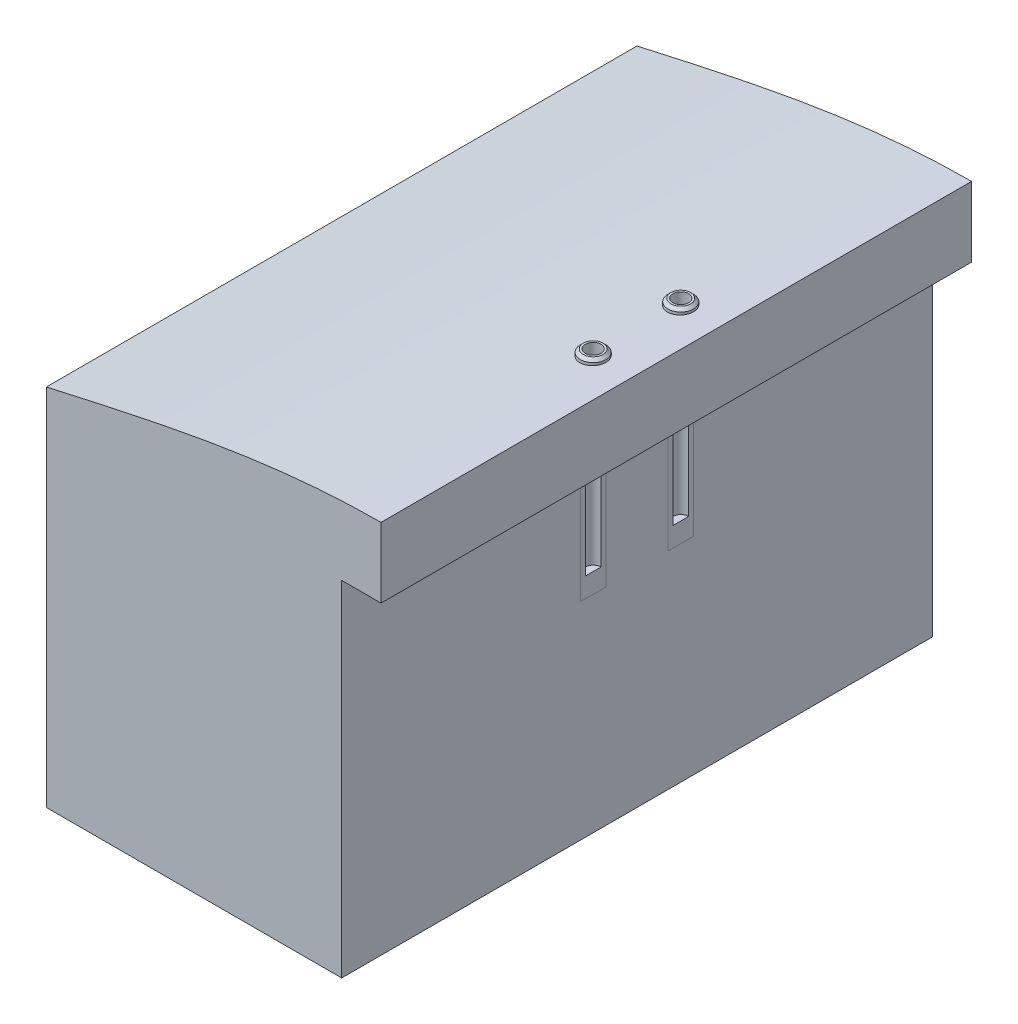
ISO-10303-21;
HEADER;
FILE_DESCRIPTION(('STEP AP214'),'2;1');
FILE_NAME('part.step','',(''),(''),'','','');
FILE_SCHEMA(('AUTOMOTIVE_DESIGN { 1 0 10303 214 1 1 1 1 }'));
ENDSEC;
DATA;
#1=APPLICATION_CONTEXT('core data for automotive mechanical design processes');
#2=APPLICATION_PROTOCOL_DEFINITION('international standard','automotive_design',2000,#1);
#3=PRODUCT_CONTEXT('',#1,'mechanical');
#4=PRODUCT('Part','Part','',(#3));
#5=PRODUCT_RELATED_PRODUCT_CATEGORY('part','',(#4));
#6=PRODUCT_DEFINITION_FORMATION('','',#4);
#7=PRODUCT_DEFINITION_CONTEXT('part definition',#1,'design');
#8=PRODUCT_DEFINITION('design','',#6,#7);
#9=PRODUCT_DEFINITION_SHAPE('','',#8);
#10=(LENGTH_UNIT() NAMED_UNIT(*) SI_UNIT(.MILLI.,.METRE.));
#11=(NAMED_UNIT(*) PLANE_ANGLE_UNIT() SI_UNIT($,.RADIAN.));
#12=(NAMED_UNIT(*) SI_UNIT($,.STERADIAN.) SOLID_ANGLE_UNIT());
#13=UNCERTAINTY_MEASURE_WITH_UNIT(LENGTH_MEASURE(1.E-05),#10,'distance_accuracy_value','');
#14=(GEOMETRIC_REPRESENTATION_CONTEXT(3) GLOBAL_UNCERTAINTY_ASSIGNED_CONTEXT((#13)) GLOBAL_UNIT_ASSIGNED_CONTEXT((#10,
#11,#12)) REPRESENTATION_CONTEXT('',''));
#15=CARTESIAN_POINT('',(0.,0.,0.));
#16=DIRECTION('',(0.,0.,1.));
#17=DIRECTION('',(1.,0.,0.));
#18=AXIS2_PLACEMENT_3D('',#15,#16,#17);
#19=CARTESIAN_POINT('',(0.,-246.769552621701,44.5));
#20=DIRECTION('',(0.,1.,0.));
#21=DIRECTION('',(0.,0.,1.));
#22=AXIS2_PLACEMENT_3D('',#19,#20,#21);
#23=CYLINDRICAL_SURFACE('',#22,13.);
#24=CARTESIAN_POINT('',(0.,2.99999999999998,44.5));
#25=DIRECTION('',(0.,1.,0.));
#26=DIRECTION('',(0.,0.,1.));
#27=AXIS2_PLACEMENT_3D('',#24,#25,#26);
#28=CIRCLE('',#27,13.);
#29=CARTESIAN_POINT('',(0.,2.99999999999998,57.5));
#30=VERTEX_POINT('',#29);
#31=EDGE_CURVE('E119',#30,#30,#28,.F.);
#32=ORIENTED_EDGE('',*,*,#31,.T.);
#33=EDGE_LOOP('',(#32));
#34=FACE_BOUND('',#33,.T.);
#35=CARTESIAN_POINT('',(0.,-70.,44.5));
#36=DIRECTION('',(0.,-1.,0.));
#37=DIRECTION('',(0.,0.,-1.));
#38=AXIS2_PLACEMENT_3D('',#35,#36,#37);
#39=CIRCLE('',#38,13.);
#40=CARTESIAN_POINT('',(0.,-70.,57.5));
#41=VERTEX_POINT('',#40);
#42=CARTESIAN_POINT('',(0.,-70.,31.5));
#43=VERTEX_POINT('',#42);
#44=EDGE_CURVE('E56',#41,#43,#39,.F.);
#45=ORIENTED_EDGE('',*,*,#44,.T.);
#46=DIRECTION('',(0.,1.,0.));
#47=VECTOR('',#46,1.);
#48=CARTESIAN_POINT('',(0.,-246.769552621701,31.5));
#49=LINE('',#48,#47);
#50=CARTESIAN_POINT('',(0.,-210.,31.5));
#51=VERTEX_POINT('',#50);
#52=EDGE_CURVE('E107',#43,#51,#49,.F.);
#53=ORIENTED_EDGE('',*,*,#52,.T.);
#54=CARTESIAN_POINT('',(0.,-210.,44.5));
#55=DIRECTION('',(0.,1.,0.));
#56=DIRECTION('',(0.,0.,1.));
#57=AXIS2_PLACEMENT_3D('',#54,#55,#56);
#58=CIRCLE('',#57,13.);
#59=CARTESIAN_POINT('',(0.,-210.,57.5));
#60=VERTEX_POINT('',#59);
#61=EDGE_CURVE('E114',#60,#51,#58,.F.);
#62=ORIENTED_EDGE('',*,*,#61,.F.);
#63=DIRECTION('',(0.,1.,0.));
#64=VECTOR('',#63,1.);
#65=CARTESIAN_POINT('',(0.,-246.769552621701,57.5));
#66=LINE('',#65,#64);
#67=EDGE_CURVE('E61',#60,#41,#66,.T.);
#68=ORIENTED_EDGE('',*,*,#67,.T.);
#69=EDGE_LOOP('',(#45,#53,#62,#68));
#70=FACE_BOUND('',#69,.T.);
#71=ADVANCED_FACE('F42',(#34,#70),#23,.T.);
#72=CARTESIAN_POINT('',(0.,-210.,44.5));
#73=DIRECTION('',(0.,1.,0.));
#74=DIRECTION('',(0.,0.,1.));
#75=AXIS2_PLACEMENT_3D('',#72,#73,#74);
#76=PLANE('',#75);
#77=DIRECTION('',(0.,0.,-1.));
#78=VECTOR('',#77,1.);
#79=CARTESIAN_POINT('',(0.,-210.,44.5));
#80=LINE('',#79,#78);
#81=EDGE_CURVE('E90',#60,#51,#80,.T.);
#82=ORIENTED_EDGE('',*,*,#81,.F.);
#83=ORIENTED_EDGE('',*,*,#61,.T.);
#84=EDGE_LOOP('',(#82,#83));
#85=FACE_BOUND('',#84,.T.);
#86=ADVANCED_FACE('F134',(#85),#76,.F.);
#87=CARTESIAN_POINT('',(0.,17.3249217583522,44.5));
#88=DIRECTION('',(0.,-1.,0.));
#89=DIRECTION('',(0.,0.,-1.));
#90=AXIS2_PLACEMENT_3D('',#87,#88,#89);
#91=CYLINDRICAL_SURFACE('',#90,8.);
#92=CARTESIAN_POINT('',(0.,6.,44.5));
#93=DIRECTION('',(0.,1.,0.));
#94=DIRECTION('',(0.,0.,1.));
#95=AXIS2_PLACEMENT_3D('',#92,#93,#94);
#96=CIRCLE('',#95,8.);
#97=CARTESIAN_POINT('',(0.,6.,52.5));
#98=VERTEX_POINT('',#97);
#99=EDGE_CURVE('E111',#98,#98,#96,.T.);
#100=ORIENTED_EDGE('',*,*,#99,.T.);
#101=EDGE_LOOP('',(#100));
#102=FACE_BOUND('',#101,.T.);
#103=CARTESIAN_POINT('',(0.,-70.,44.5));
#104=DIRECTION('',(0.,-1.,0.));
#105=DIRECTION('',(0.,0.,-1.));
#106=AXIS2_PLACEMENT_3D('',#103,#104,#105);
#107=CIRCLE('',#106,8.);
#108=CARTESIAN_POINT('',(0.,-70.,36.5));
#109=VERTEX_POINT('',#108);
#110=CARTESIAN_POINT('',(0.,-70.,52.5));
#111=VERTEX_POINT('',#110);
#112=EDGE_CURVE('E13',#109,#111,#107,.T.);
#113=ORIENTED_EDGE('',*,*,#112,.T.);
#114=DIRECTION('',(0.,-1.,0.));
#115=VECTOR('',#114,1.);
#116=CARTESIAN_POINT('',(0.,17.3249217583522,52.5));
#117=LINE('',#116,#115);
#118=CARTESIAN_POINT('',(0.,-190.,52.5));
#119=VERTEX_POINT('',#118);
#120=EDGE_CURVE('E82',#111,#119,#117,.T.);
#121=ORIENTED_EDGE('',*,*,#120,.T.);
#122=CARTESIAN_POINT('',(0.,-190.,44.5));
#123=DIRECTION('',(0.,1.,0.));
#124=DIRECTION('',(0.,0.,1.));
#125=AXIS2_PLACEMENT_3D('',#122,#123,#124);
#126=CIRCLE('',#125,8.);
#127=CARTESIAN_POINT('',(0.,-190.,36.5));
#128=VERTEX_POINT('',#127);
#129=EDGE_CURVE('E101',#119,#128,#126,.F.);
#130=ORIENTED_EDGE('',*,*,#129,.T.);
#131=DIRECTION('',(0.,-1.,0.));
#132=VECTOR('',#131,1.);
#133=CARTESIAN_POINT('',(0.,17.3249217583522,36.5));
#134=LINE('',#133,#132);
#135=EDGE_CURVE('E91',#128,#109,#134,.F.);
#136=ORIENTED_EDGE('',*,*,#135,.T.);
#137=EDGE_LOOP('',(#113,#121,#130,#136));
#138=FACE_BOUND('',#137,.T.);
#139=ADVANCED_FACE('F100',(#102,#138),#91,.F.);
#140=CARTESIAN_POINT('',(0.,-190.,44.5));
#141=DIRECTION('',(0.,1.,0.));
#142=DIRECTION('',(0.,0.,1.));
#143=AXIS2_PLACEMENT_3D('',#140,#141,#142);
#144=PLANE('',#143);
#145=ORIENTED_EDGE('',*,*,#129,.F.);
#146=DIRECTION('',(0.,0.,-1.));
#147=VECTOR('',#146,1.);
#148=CARTESIAN_POINT('',(0.,-190.,44.5));
#149=LINE('',#148,#147);
#150=EDGE_CURVE('E49',#119,#128,#149,.T.);
#151=ORIENTED_EDGE('',*,*,#150,.T.);
#152=EDGE_LOOP('',(#145,#151));
#153=FACE_BOUND('',#152,.T.);
#154=ADVANCED_FACE('F122',(#153),#144,.T.);
#155=CARTESIAN_POINT('',(0.,6.,44.5));
#156=DIRECTION('',(0.,1.,0.));
#157=DIRECTION('',(0.,0.,1.));
#158=AXIS2_PLACEMENT_3D('',#155,#156,#157);
#159=PLANE('',#158);
#160=CARTESIAN_POINT('',(0.,6.,44.5));
#161=DIRECTION('',(0.,1.,0.));
#162=DIRECTION('',(0.,0.,1.));
#163=AXIS2_PLACEMENT_3D('',#160,#161,#162);
#164=CIRCLE('',#163,10.);
#165=CARTESIAN_POINT('',(0.,6.,54.5));
#166=VERTEX_POINT('',#165);
#167=EDGE_CURVE('E116',#166,#166,#164,.T.);
#168=ORIENTED_EDGE('',*,*,#167,.T.);
#169=EDGE_LOOP('',(#168));
#170=FACE_BOUND('',#169,.T.);
#171=ORIENTED_EDGE('',*,*,#99,.F.);
#172=EDGE_LOOP('',(#171));
#173=FACE_BOUND('',#172,.T.);
#174=ADVANCED_FACE('F124',(#170,#173),#159,.T.);
#175=CARTESIAN_POINT('',(0.,5.99999999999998,44.5));
#176=DIRECTION('',(0.,-1.,0.));
#177=DIRECTION('',(0.,0.,-1.));
#178=AXIS2_PLACEMENT_3D('',#175,#176,#177);
#179=CONICAL_SURFACE('',#178,10.,0.78539816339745);
#180=ORIENTED_EDGE('',*,*,#31,.F.);
#181=EDGE_LOOP('',(#180));
#182=FACE_BOUND('',#181,.T.);
#183=ORIENTED_EDGE('',*,*,#167,.F.);
#184=EDGE_LOOP('',(#183));
#185=FACE_BOUND('',#184,.T.);
#186=ADVANCED_FACE('F131',(#182,#185),#179,.T.);
#187=CARTESIAN_POINT('',(40.,-70.,1568.15532611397));
#188=DIRECTION('',(0.,-1.,0.));
#189=DIRECTION('',(0.,0.,-1.));
#190=AXIS2_PLACEMENT_3D('',#187,#188,#189);
#191=PLANE('',#190);
#192=ORIENTED_EDGE('',*,*,#44,.F.);
#193=DIRECTION('',(0.,0.,-1.));
#194=VECTOR('',#193,1.);
#195=CARTESIAN_POINT('',(0.,-70.,1568.15532611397));
#196=LINE('',#195,#194);
#197=EDGE_CURVE('E85',#41,#111,#196,.T.);
#198=ORIENTED_EDGE('',*,*,#197,.T.);
#199=ORIENTED_EDGE('',*,*,#112,.F.);
#200=EDGE_CURVE('E97',#109,#43,#196,.T.);
#201=ORIENTED_EDGE('',*,*,#200,.T.);
#202=EDGE_LOOP('',(#192,#198,#199,#201));
#203=FACE_BOUND('',#202,.T.);
#204=ADVANCED_FACE('F94',(#203),#191,.T.);
#205=CARTESIAN_POINT('',(0.,-70.,1568.15532611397));
#206=DIRECTION('',(1.,0.,0.));
#207=DIRECTION('',(0.,1.,0.));
#208=AXIS2_PLACEMENT_3D('',#205,#206,#207);
#209=PLANE('',#208);
#210=ORIENTED_EDGE('',*,*,#52,.F.);
#211=ORIENTED_EDGE('',*,*,#200,.F.);
#212=ORIENTED_EDGE('',*,*,#135,.F.);
#213=ORIENTED_EDGE('',*,*,#150,.F.);
#214=ORIENTED_EDGE('',*,*,#120,.F.);
#215=ORIENTED_EDGE('',*,*,#197,.F.);
#216=ORIENTED_EDGE('',*,*,#67,.F.);
#217=ORIENTED_EDGE('',*,*,#81,.T.);
#218=EDGE_LOOP('',(#210,#211,#212,#213,#214,#215,#216,#217));
#219=FACE_BOUND('',#218,.T.);
#220=ADVANCED_FACE('F84',(#219),#209,.T.);
#221=CLOSED_SHELL('',(#71,#86,#139,#154,#174,#186,#204,#220));
#222=MANIFOLD_SOLID_BREP('B2',#221);
#223=CARTESIAN_POINT('',(0.,-246.769552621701,-44.5));
#224=DIRECTION('',(0.,1.,0.));
#225=DIRECTION('',(0.,0.,1.));
#226=AXIS2_PLACEMENT_3D('',#223,#224,#225);
#227=CYLINDRICAL_SURFACE('',#226,13.);
#228=CARTESIAN_POINT('',(0.,3.,-44.5));
#229=DIRECTION('',(0.,1.,0.));
#230=DIRECTION('',(0.,0.,1.));
#231=AXIS2_PLACEMENT_3D('',#228,#229,#230);
#232=CIRCLE('',#231,13.);
#233=CARTESIAN_POINT('',(0.,3.,-57.5));
#234=VERTEX_POINT('',#233);
#235=EDGE_CURVE('E271',#234,#234,#232,.F.);
#236=ORIENTED_EDGE('',*,*,#235,.T.);
#237=EDGE_LOOP('',(#236));
#238=FACE_BOUND('',#237,.T.);
#239=CARTESIAN_POINT('',(0.,-70.,-44.5));
#240=DIRECTION('',(0.,-1.,0.));
#241=DIRECTION('',(0.,0.,-1.));
#242=AXIS2_PLACEMENT_3D('',#239,#240,#241);
#243=CIRCLE('',#242,13.);
#244=CARTESIAN_POINT('',(0.,-70.,-31.5));
#245=VERTEX_POINT('',#244);
#246=CARTESIAN_POINT('',(0.,-70.,-57.5));
#247=VERTEX_POINT('',#246);
#248=EDGE_CURVE('E208',#245,#247,#243,.F.);
#249=ORIENTED_EDGE('',*,*,#248,.T.);
#250=DIRECTION('',(0.,1.,0.));
#251=VECTOR('',#250,1.);
#252=CARTESIAN_POINT('',(0.,-246.769552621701,-57.5));
#253=LINE('',#252,#251);
#254=CARTESIAN_POINT('',(0.,-210.,-57.5));
#255=VERTEX_POINT('',#254);
#256=EDGE_CURVE('E259',#247,#255,#253,.F.);
#257=ORIENTED_EDGE('',*,*,#256,.T.);
#258=CARTESIAN_POINT('',(0.,-210.,-44.5));
#259=DIRECTION('',(0.,1.,0.));
#260=DIRECTION('',(0.,0.,1.));
#261=AXIS2_PLACEMENT_3D('',#258,#259,#260);
#262=CIRCLE('',#261,13.);
#263=CARTESIAN_POINT('',(0.,-210.,-31.5));
#264=VERTEX_POINT('',#263);
#265=EDGE_CURVE('E266',#264,#255,#262,.F.);
#266=ORIENTED_EDGE('',*,*,#265,.F.);
#267=DIRECTION('',(0.,1.,0.));
#268=VECTOR('',#267,1.);
#269=CARTESIAN_POINT('',(0.,-246.769552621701,-31.5));
#270=LINE('',#269,#268);
#271=EDGE_CURVE('E213',#264,#245,#270,.T.);
#272=ORIENTED_EDGE('',*,*,#271,.T.);
#273=EDGE_LOOP('',(#249,#257,#266,#272));
#274=FACE_BOUND('',#273,.T.);
#275=ADVANCED_FACE('F194',(#238,#274),#227,.T.);
#276=CARTESIAN_POINT('',(0.,-210.,44.5));
#277=DIRECTION('',(0.,1.,0.));
#278=DIRECTION('',(0.,0.,1.));
#279=AXIS2_PLACEMENT_3D('',#276,#277,#278);
#280=PLANE('',#279);
#281=DIRECTION('',(0.,0.,-1.));
#282=VECTOR('',#281,1.);
#283=CARTESIAN_POINT('',(0.,-210.,44.5));
#284=LINE('',#283,#282);
#285=EDGE_CURVE('E242',#264,#255,#284,.T.);
#286=ORIENTED_EDGE('',*,*,#285,.F.);
#287=ORIENTED_EDGE('',*,*,#265,.T.);
#288=EDGE_LOOP('',(#286,#287));
#289=FACE_BOUND('',#288,.T.);
#290=ADVANCED_FACE('F286',(#289),#280,.F.);
#291=CARTESIAN_POINT('',(0.,17.3249217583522,-44.5));
#292=DIRECTION('',(0.,-1.,0.));
#293=DIRECTION('',(0.,0.,-1.));
#294=AXIS2_PLACEMENT_3D('',#291,#292,#293);
#295=CYLINDRICAL_SURFACE('',#294,8.);
#296=CARTESIAN_POINT('',(0.,6.,-44.5));
#297=DIRECTION('',(0.,1.,0.));
#298=DIRECTION('',(0.,0.,1.));
#299=AXIS2_PLACEMENT_3D('',#296,#297,#298);
#300=CIRCLE('',#299,8.);
#301=CARTESIAN_POINT('',(0.,6.,-36.5));
#302=VERTEX_POINT('',#301);
#303=EDGE_CURVE('E263',#302,#302,#300,.T.);
#304=ORIENTED_EDGE('',*,*,#303,.T.);
#305=EDGE_LOOP('',(#304));
#306=FACE_BOUND('',#305,.T.);
#307=CARTESIAN_POINT('',(0.,-70.,-44.5));
#308=DIRECTION('',(0.,-1.,0.));
#309=DIRECTION('',(0.,0.,-1.));
#310=AXIS2_PLACEMENT_3D('',#307,#308,#309);
#311=CIRCLE('',#310,8.);
#312=CARTESIAN_POINT('',(0.,-70.,-52.5));
#313=VERTEX_POINT('',#312);
#314=CARTESIAN_POINT('',(0.,-70.,-36.5));
#315=VERTEX_POINT('',#314);
#316=EDGE_CURVE('E40',#313,#315,#311,.T.);
#317=ORIENTED_EDGE('',*,*,#316,.T.);
#318=DIRECTION('',(0.,-1.,0.));
#319=VECTOR('',#318,1.);
#320=CARTESIAN_POINT('',(0.,17.3249217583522,-36.5));
#321=LINE('',#320,#319);
#322=CARTESIAN_POINT('',(0.,-190.,-36.5));
#323=VERTEX_POINT('',#322);
#324=EDGE_CURVE('E234',#315,#323,#321,.T.);
#325=ORIENTED_EDGE('',*,*,#324,.T.);
#326=CARTESIAN_POINT('',(0.,-190.,-44.5));
#327=DIRECTION('',(0.,1.,0.));
#328=DIRECTION('',(0.,0.,1.));
#329=AXIS2_PLACEMENT_3D('',#326,#327,#328);
#330=CIRCLE('',#329,8.);
#331=CARTESIAN_POINT('',(0.,-190.,-52.5));
#332=VERTEX_POINT('',#331);
#333=EDGE_CURVE('E253',#323,#332,#330,.F.);
#334=ORIENTED_EDGE('',*,*,#333,.T.);
#335=DIRECTION('',(0.,-1.,0.));
#336=VECTOR('',#335,1.);
#337=CARTESIAN_POINT('',(0.,17.3249217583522,-52.5));
#338=LINE('',#337,#336);
#339=EDGE_CURVE('E243',#332,#313,#338,.F.);
#340=ORIENTED_EDGE('',*,*,#339,.T.);
#341=EDGE_LOOP('',(#317,#325,#334,#340));
#342=FACE_BOUND('',#341,.T.);
#343=ADVANCED_FACE('F252',(#306,#342),#295,.F.);
#344=CARTESIAN_POINT('',(0.,-190.,44.5));
#345=DIRECTION('',(0.,1.,0.));
#346=DIRECTION('',(0.,0.,1.));
#347=AXIS2_PLACEMENT_3D('',#344,#345,#346);
#348=PLANE('',#347);
#349=ORIENTED_EDGE('',*,*,#333,.F.);
#350=DIRECTION('',(0.,0.,-1.));
#351=VECTOR('',#350,1.);
#352=CARTESIAN_POINT('',(0.,-190.,44.5));
#353=LINE('',#352,#351);
#354=EDGE_CURVE('E201',#323,#332,#353,.T.);
#355=ORIENTED_EDGE('',*,*,#354,.T.);
#356=EDGE_LOOP('',(#349,#355));
#357=FACE_BOUND('',#356,.T.);
#358=ADVANCED_FACE('F274',(#357),#348,.T.);
#359=CARTESIAN_POINT('',(0.,6.,-44.5));
#360=DIRECTION('',(0.,1.,0.));
#361=DIRECTION('',(0.,0.,1.));
#362=AXIS2_PLACEMENT_3D('',#359,#360,#361);
#363=PLANE('',#362);
#364=CARTESIAN_POINT('',(0.,6.,-44.5));
#365=DIRECTION('',(0.,1.,0.));
#366=DIRECTION('',(0.,0.,1.));
#367=AXIS2_PLACEMENT_3D('',#364,#365,#366);
#368=CIRCLE('',#367,10.);
#369=CARTESIAN_POINT('',(0.,6.,-54.5));
#370=VERTEX_POINT('',#369);
#371=EDGE_CURVE('E268',#370,#370,#368,.T.);
#372=ORIENTED_EDGE('',*,*,#371,.T.);
#373=EDGE_LOOP('',(#372));
#374=FACE_BOUND('',#373,.T.);
#375=ORIENTED_EDGE('',*,*,#303,.F.);
#376=EDGE_LOOP('',(#375));
#377=FACE_BOUND('',#376,.T.);
#378=ADVANCED_FACE('F276',(#374,#377),#363,.T.);
#379=CARTESIAN_POINT('',(0.,5.99999999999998,-44.5));
#380=DIRECTION('',(0.,-1.,0.));
#381=DIRECTION('',(0.,0.,-1.));
#382=AXIS2_PLACEMENT_3D('',#379,#380,#381);
#383=CONICAL_SURFACE('',#382,10.,0.785398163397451);
#384=CARTESIAN_POINT('',(0.,3.,-57.5));
#385=CARTESIAN_POINT('',(0.,3.03125,-57.46875));
#386=CARTESIAN_POINT('',(0.,3.0625,-57.4375));
#387=CARTESIAN_POINT('',(0.,3.125,-57.375));
#388=CARTESIAN_POINT('',(0.,3.15625,-57.34375));
#389=CARTESIAN_POINT('',(0.,3.21875,-57.28125));
#390=CARTESIAN_POINT('',(0.,3.25,-57.25));
#391=CARTESIAN_POINT('',(0.,3.3125,-57.1875));
#392=CARTESIAN_POINT('',(0.,3.34375,-57.15625));
#393=CARTESIAN_POINT('',(0.,3.40625,-57.09375));
#394=CARTESIAN_POINT('',(0.,3.4375,-57.0625));
#395=CARTESIAN_POINT('',(0.,3.5,-57.));
#396=CARTESIAN_POINT('',(0.,3.53125,-56.96875));
#397=CARTESIAN_POINT('',(0.,3.59375,-56.90625));
#398=CARTESIAN_POINT('',(0.,3.625,-56.875));
#399=CARTESIAN_POINT('',(0.,3.6875,-56.8125));
#400=CARTESIAN_POINT('',(0.,3.71875,-56.78125));
#401=CARTESIAN_POINT('',(0.,3.78125,-56.71875));
#402=CARTESIAN_POINT('',(0.,3.8125,-56.6875));
#403=CARTESIAN_POINT('',(0.,3.875,-56.625));
#404=CARTESIAN_POINT('',(0.,3.90625,-56.59375));
#405=CARTESIAN_POINT('',(0.,3.96875,-56.53125));
#406=CARTESIAN_POINT('',(0.,4.,-56.5));
#407=CARTESIAN_POINT('',(0.,4.0625,-56.4375));
#408=CARTESIAN_POINT('',(0.,4.09375,-56.40625));
#409=CARTESIAN_POINT('',(0.,4.15625,-56.34375));
#410=CARTESIAN_POINT('',(0.,4.1875,-56.3125));
#411=CARTESIAN_POINT('',(0.,4.25,-56.25));
#412=CARTESIAN_POINT('',(0.,4.28125,-56.21875));
#413=CARTESIAN_POINT('',(0.,4.34375,-56.15625));
#414=CARTESIAN_POINT('',(0.,4.375,-56.125));
#415=CARTESIAN_POINT('',(0.,4.4375,-56.0625));
#416=CARTESIAN_POINT('',(0.,4.46875,-56.03125));
#417=CARTESIAN_POINT('',(0.,4.53125,-55.96875));
#418=CARTESIAN_POINT('',(0.,4.5625,-55.9375));
#419=CARTESIAN_POINT('',(0.,4.625,-55.875));
#420=CARTESIAN_POINT('',(0.,4.65625,-55.84375));
#421=CARTESIAN_POINT('',(0.,4.71875,-55.78125));
#422=CARTESIAN_POINT('',(0.,4.75,-55.75));
#423=CARTESIAN_POINT('',(0.,4.8125,-55.6875));
#424=CARTESIAN_POINT('',(0.,4.84375,-55.65625));
#425=CARTESIAN_POINT('',(0.,4.90625,-55.59375));
#426=CARTESIAN_POINT('',(0.,4.9375,-55.5625));
#427=CARTESIAN_POINT('',(0.,5.,-55.5));
#428=CARTESIAN_POINT('',(0.,5.03125,-55.46875));
#429=CARTESIAN_POINT('',(0.,5.09375,-55.40625));
#430=CARTESIAN_POINT('',(0.,5.125,-55.375));
#431=CARTESIAN_POINT('',(0.,5.1875,-55.3125));
#432=CARTESIAN_POINT('',(0.,5.21875,-55.28125));
#433=CARTESIAN_POINT('',(0.,5.28125,-55.21875));
#434=CARTESIAN_POINT('',(0.,5.3125,-55.1875));
#435=CARTESIAN_POINT('',(0.,5.375,-55.125));
#436=CARTESIAN_POINT('',(0.,5.40625,-55.09375));
#437=CARTESIAN_POINT('',(0.,5.46875,-55.03125));
#438=CARTESIAN_POINT('',(0.,5.5,-55.));
#439=CARTESIAN_POINT('',(0.,5.5625,-54.9375));
#440=CARTESIAN_POINT('',(0.,5.59375,-54.90625));
#441=CARTESIAN_POINT('',(0.,5.65625,-54.84375));
#442=CARTESIAN_POINT('',(0.,5.6875,-54.8125));
#443=CARTESIAN_POINT('',(0.,5.75,-54.75));
#444=CARTESIAN_POINT('',(0.,5.78125,-54.71875));
#445=CARTESIAN_POINT('',(0.,5.84375,-54.65625));
#446=CARTESIAN_POINT('',(0.,5.875,-54.625));
#447=CARTESIAN_POINT('',(0.,5.9375,-54.5625));
#448=CARTESIAN_POINT('',(0.,5.96875,-54.53125));
#449=CARTESIAN_POINT('',(0.,6.,-54.5));
#450=B_SPLINE_CURVE_WITH_KNOTS('',3,(#384,#385,#386,#387,#388,#389,#390,#391,#392,#393,#394,
#395,#396,#397,#398,#399,#400,#401,#402,#403,#404,#405,#406,#407,#408,#409,#410,#411,#412,#413,
#414,#415,#416,#417,#418,#419,#420,#421,#422,#423,#424,#425,#426,#427,#428,#429,#430,#431,#432,
#433,#434,#435,#436,#437,#438,#439,#440,#441,#442,#443,#444,#445,#446,#447,#448,#449),
.UNSPECIFIED.,.F.,.F.,(4,2,2,2,2,2,2,2,2,2,2,2,2,2,2,2,2,2,2,2,2,2,2,2,2,2,2,2,2,2,2,2,4),(0.,
0.132582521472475,0.26516504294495,0.397747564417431,0.530330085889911,0.662912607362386,
0.795495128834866,0.928077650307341,1.06066017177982,1.1932426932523,1.32582521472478,
1.45840773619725,1.59099025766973,1.72357277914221,1.85615530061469,1.98873782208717,
2.12132034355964,2.25390286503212,2.3864853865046,2.51906790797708,2.65165042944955,
2.78423295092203,2.91681547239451,3.04939799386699,3.18198051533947,3.31456303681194,
3.44714555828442,3.5797280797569,3.71231060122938,3.84489312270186,3.97747564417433,
4.11005816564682,4.24264068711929),.UNSPECIFIED.);
#451=EDGE_CURVE('BSEAM283',#234,#370,#450,.T.);
#452=ORIENTED_EDGE('',*,*,#235,.F.);
#453=ORIENTED_EDGE('',*,*,#371,.F.);
#454=ORIENTED_EDGE('',*,*,#451,.T.);
#455=ORIENTED_EDGE('',*,*,#451,.F.);
#456=EDGE_LOOP('',(#452,#454,#453,#455));
#457=FACE_BOUND('',#456,.T.);
#458=ADVANCED_FACE('F283',(#457),#383,.T.);
#459=CARTESIAN_POINT('',(40.,-70.,1568.15532611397));
#460=DIRECTION('',(0.,-1.,0.));
#461=DIRECTION('',(0.,0.,-1.));
#462=AXIS2_PLACEMENT_3D('',#459,#460,#461);
#463=PLANE('',#462);
#464=ORIENTED_EDGE('',*,*,#248,.F.);
#465=DIRECTION('',(0.,0.,-1.));
#466=VECTOR('',#465,1.);
#467=CARTESIAN_POINT('',(0.,-70.,1568.15532611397));
#468=LINE('',#467,#466);
#469=EDGE_CURVE('E237',#245,#315,#468,.T.);
#470=ORIENTED_EDGE('',*,*,#469,.T.);
#471=ORIENTED_EDGE('',*,*,#316,.F.);
#472=EDGE_CURVE('E249',#313,#247,#468,.T.);
#473=ORIENTED_EDGE('',*,*,#472,.T.);
#474=EDGE_LOOP('',(#464,#470,#471,#473));
#475=FACE_BOUND('',#474,.T.);
#476=ADVANCED_FACE('F246',(#475),#463,.T.);
#477=CARTESIAN_POINT('',(0.,-70.,1568.15532611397));
#478=DIRECTION('',(1.,0.,0.));
#479=DIRECTION('',(0.,1.,0.));
#480=AXIS2_PLACEMENT_3D('',#477,#478,#479);
#481=PLANE('',#480);
#482=ORIENTED_EDGE('',*,*,#256,.F.);
#483=ORIENTED_EDGE('',*,*,#472,.F.);
#484=ORIENTED_EDGE('',*,*,#339,.F.);
#485=ORIENTED_EDGE('',*,*,#354,.F.);
#486=ORIENTED_EDGE('',*,*,#324,.F.);
#487=ORIENTED_EDGE('',*,*,#469,.F.);
#488=ORIENTED_EDGE('',*,*,#271,.F.);
#489=ORIENTED_EDGE('',*,*,#285,.T.);
#490=EDGE_LOOP('',(#482,#483,#484,#485,#486,#487,#488,#489));
#491=FACE_BOUND('',#490,.T.);
#492=ADVANCED_FACE('F236',(#491),#481,.T.);
#493=CLOSED_SHELL('',(#275,#290,#343,#358,#378,#458,#476,#492));
#494=MANIFOLD_SOLID_BREP('B7',#493);
#495=CARTESIAN_POINT('',(300.,-19.844883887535,300.));
#496=CARTESIAN_POINT('',(199.717435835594,-7.50258695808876,300.));
#497=CARTESIAN_POINT('',(-2.00076682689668,17.3239217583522,300.));
#498=CARTESIAN_POINT('',(-200.289099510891,-27.3701210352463,300.));
#499=CARTESIAN_POINT('',(-300.,-49.844883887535,300.));
#500=B_SPLINE_CURVE_WITH_KNOTS('',3,(#495,#496,#497,#498,#499),.UNSPECIFIED.,.F.,.F.,(4,1,4),
(0.,0.49714186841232,1.),.UNSPECIFIED.);
#501=DIRECTION('',(0.,0.,-1.));
#502=VECTOR('',#501,1.);
#503=SURFACE_OF_LINEAR_EXTRUSION('',#500,#502);
#504=CARTESIAN_POINT('',(0.,0.,-57.5));
#505=CARTESIAN_POINT('',(-0.365705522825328,-0.0177995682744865,-57.5000025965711));
#506=CARTESIAN_POINT('',(-0.731356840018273,-0.0358301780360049,-57.484562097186));
#507=CARTESIAN_POINT('',(-1.46015986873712,-0.0722284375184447,-57.4229127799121));
#508=CARTESIAN_POINT('',(-1.82331089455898,-0.0905961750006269,-57.3766958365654));
#509=CARTESIAN_POINT('',(-2.54479918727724,-0.127536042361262,-57.2537472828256));
#510=CARTESIAN_POINT('',(-2.90313082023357,-0.146108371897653,-57.1769827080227));
#511=CARTESIAN_POINT('',(-3.61203650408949,-0.183280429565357,-56.9934879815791));
#512=CARTESIAN_POINT('',(-3.9626105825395,-0.201880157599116,-56.8867579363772));
#513=CARTESIAN_POINT('',(-4.65334041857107,-0.238931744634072,-56.6441488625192));
#514=CARTESIAN_POINT('',(-4.99350111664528,-0.25738367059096,-56.5082839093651));
#515=CARTESIAN_POINT('',(-5.66116887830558,-0.293976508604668,-56.2083348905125));
#516=CARTESIAN_POINT('',(-5.98867574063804,-0.312117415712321,-56.0442503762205));
#517=CARTESIAN_POINT('',(-6.62861834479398,-0.347906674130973,-55.6890707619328));
#518=CARTESIAN_POINT('',(-6.94105792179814,-0.3655551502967,-55.4979825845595));
#519=CARTESIAN_POINT('',(-7.54873077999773,-0.40018627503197,-55.0901165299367));
#520=CARTESIAN_POINT('',(-7.84396413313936,-0.4171689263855,-54.8733387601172));
#521=CARTESIAN_POINT('',(-8.41509466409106,-0.450290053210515,-54.4156485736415));
#522=CARTESIAN_POINT('',(-8.69099367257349,-0.466428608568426,-54.1747384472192));
#523=CARTESIAN_POINT('',(-9.22151722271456,-0.497690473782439,-53.6704719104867));
#524=CARTESIAN_POINT('',(-9.47614174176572,-0.512813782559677,-53.4071154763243));
#525=CARTESIAN_POINT('',(-9.96230333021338,-0.541879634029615,-52.8598139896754));
#526=CARTESIAN_POINT('',(-10.1938395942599,-0.555822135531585,-52.5758682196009));
#527=CARTESIAN_POINT('',(-10.6321547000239,-0.582369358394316,-51.9894124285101));
#528=CARTESIAN_POINT('',(-10.8389335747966,-0.594974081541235,-51.6869024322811));
#529=CARTESIAN_POINT('',(-11.2259823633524,-0.618685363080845,-51.0658967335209));
#530=CARTESIAN_POINT('',(-11.4062883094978,-0.629793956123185,-50.7474235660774));
#531=CARTESIAN_POINT('',(-11.7394349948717,-0.650404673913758,-50.0963719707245));
#532=CARTESIAN_POINT('',(-11.8922757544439,-0.659906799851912,-49.7637935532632));
#533=CARTESIAN_POINT('',(-12.1693908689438,-0.677192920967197,-49.0869018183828));
#534=CARTESIAN_POINT('',(-12.2936655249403,-0.684976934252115,-48.7425886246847));
#535=CARTESIAN_POINT('',(-12.5127544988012,-0.698734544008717,-48.044678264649));
#536=CARTESIAN_POINT('',(-12.6075688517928,-0.70470814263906,-47.6910811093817));
#537=CARTESIAN_POINT('',(-12.7669098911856,-0.714764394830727,-46.9777661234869));
#538=CARTESIAN_POINT('',(-12.8314905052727,-0.718850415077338,-46.6180603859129));
#539=CARTESIAN_POINT('',(-12.9301496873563,-0.725098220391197,-45.8944735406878));
#540=CARTESIAN_POINT('',(-12.9642282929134,-0.727260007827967,-45.530592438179));
#541=CARTESIAN_POINT('',(-13.0016376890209,-0.729633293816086,-44.8012498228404));
#542=CARTESIAN_POINT('',(-13.0049687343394,-0.729844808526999,-44.4357883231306));
#543=CARTESIAN_POINT('',(-12.9808596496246,-0.728315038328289,-43.7058858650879));
#544=CARTESIAN_POINT('',(-12.9534195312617,-0.7265737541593,-43.3414449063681));
#545=CARTESIAN_POINT('',(-12.8680098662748,-0.721162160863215,-42.6165518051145));
#546=CARTESIAN_POINT('',(-12.8100716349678,-0.717493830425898,-42.2560959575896));
#547=CARTESIAN_POINT('',(-12.6641012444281,-0.708273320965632,-41.5413550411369));
#548=CARTESIAN_POINT('',(-12.576069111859,-0.702721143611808,-41.187069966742));
#549=CARTESIAN_POINT('',(-12.3705430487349,-0.689799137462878,-40.487184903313));
#550=CARTESIAN_POINT('',(-12.2530490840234,-0.682429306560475,-40.1415849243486));
#551=CARTESIAN_POINT('',(-11.989441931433,-0.665959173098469,-39.4615204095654));
#552=CARTESIAN_POINT('',(-11.8433287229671,-0.656858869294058,-39.1270558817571));
#553=CARTESIAN_POINT('',(-11.5234511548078,-0.637029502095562,-38.471470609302));
#554=CARTESIAN_POINT('',(-11.3496733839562,-0.626299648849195,-38.1503564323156));
#555=CARTESIAN_POINT('',(-10.9757602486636,-0.603338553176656,-37.5239160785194));
#556=CARTESIAN_POINT('',(-10.7756248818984,-0.591107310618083,-37.2185899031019));
#557=CARTESIAN_POINT('',(-10.3504231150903,-0.565282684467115,-36.6258798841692));
#558=CARTESIAN_POINT('',(-10.125356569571,-0.551689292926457,-36.3384961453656));
#559=CARTESIAN_POINT('',(-9.65189541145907,-0.523292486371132,-35.7836987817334));
#560=CARTESIAN_POINT('',(-9.40350076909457,-0.50848906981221,-35.5162851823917));
#561=CARTESIAN_POINT('',(-8.88472273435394,-0.47780925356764,-35.0028901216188));
#562=CARTESIAN_POINT('',(-8.61430397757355,-0.461931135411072,-34.7569444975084));
#563=CARTESIAN_POINT('',(-8.05375514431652,-0.429294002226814,-34.288712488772));
#564=CARTESIAN_POINT('',(-7.76362504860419,-0.412534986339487,-34.0664261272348));
#565=CARTESIAN_POINT('',(-7.16571098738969,-0.378310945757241,-33.6470775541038));
#566=CARTESIAN_POINT('',(-6.8579268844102,-0.360845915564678,-33.4500155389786));
#567=CARTESIAN_POINT('',(-6.22688863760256,-0.325386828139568,-33.0825056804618));
#568=CARTESIAN_POINT('',(-5.90363447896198,-0.307392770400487,-32.9120578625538));
#569=CARTESIAN_POINT('',(-5.24340124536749,-0.271021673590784,-32.5987191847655));
#570=CARTESIAN_POINT('',(-4.90640044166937,-0.252644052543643,-32.4558741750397));
#571=CARTESIAN_POINT('',(-4.22156619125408,-0.215708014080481,-32.1991011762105));
#572=CARTESIAN_POINT('',(-3.87373273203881,-0.197149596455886,-32.0851732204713));
#573=CARTESIAN_POINT('',(-3.16969991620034,-0.160019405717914,-31.8870410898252));
#574=CARTESIAN_POINT('',(-2.81350052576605,-0.141447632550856,-31.8028370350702));
#575=CARTESIAN_POINT('',(-2.09526445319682,-0.104450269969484,-31.6647516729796));
#576=CARTESIAN_POINT('',(-1.73322777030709,-0.086024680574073,-31.610870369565));
#577=CARTESIAN_POINT('',(-1.0056381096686,-0.0494565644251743,-31.5337894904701));
#578=CARTESIAN_POINT('',(-0.640082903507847,-0.0313142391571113,-31.5106108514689));
#579=CARTESIAN_POINT('',(0.0917013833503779,0.00453604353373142,-31.4951729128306));
#580=CARTESIAN_POINT('',(0.457930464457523,0.0222440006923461,-31.5029136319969));
#581=CARTESIAN_POINT('',(1.18845640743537,0.0571030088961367,-31.5492654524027));
#582=CARTESIAN_POINT('',(1.55275327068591,0.0742540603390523,-31.5878765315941));
#583=CARTESIAN_POINT('',(2.27682070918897,0.107891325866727,-31.695701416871));
#584=CARTESIAN_POINT('',(2.63659128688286,0.124377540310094,-31.7649152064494));
#585=CARTESIAN_POINT('',(3.34889344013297,0.15658422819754,-31.9334253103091));
#586=CARTESIAN_POINT('',(3.70142796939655,0.172305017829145,-32.032709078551));
#587=CARTESIAN_POINT('',(4.39689944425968,0.202908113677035,-32.2606704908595));
#588=CARTESIAN_POINT('',(4.73983639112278,0.217790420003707,-32.3893481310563));
#589=CARTESIAN_POINT('',(5.41366449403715,0.246649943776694,-32.6751882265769));
#590=CARTESIAN_POINT('',(5.74455569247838,0.260627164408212,-32.8323505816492));
#591=CARTESIAN_POINT('',(6.39193028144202,0.287622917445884,-33.1740479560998));
#592=CARTESIAN_POINT('',(6.70841368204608,0.30064145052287,-33.3585829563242));
#593=CARTESIAN_POINT('',(7.3244183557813,0.325666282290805,-33.7535294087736));
#594=CARTESIAN_POINT('',(7.62395542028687,0.337673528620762,-33.9639161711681));
#595=CARTESIAN_POINT('',(8.20425273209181,0.360658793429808,-34.4092123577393));
#596=CARTESIAN_POINT('',(8.48501298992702,0.371636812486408,-34.6441217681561));
#597=CARTESIAN_POINT('',(9.02575011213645,0.392542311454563,-35.1367946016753));
#598=CARTESIAN_POINT('',(9.28572704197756,0.402469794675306,-35.3945579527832));
#599=CARTESIAN_POINT('',(9.78304017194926,0.421261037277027,-35.9311070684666));
#600=CARTESIAN_POINT('',(10.0203763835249,0.430124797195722,-36.2098928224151));
#601=CARTESIAN_POINT('',(10.4705117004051,0.446774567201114,-36.7862480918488));
#602=CARTESIAN_POINT('',(10.6833323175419,0.454561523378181,-37.0838007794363));
#603=CARTESIAN_POINT('',(11.083159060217,0.469065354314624,-37.6957965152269));
#604=CARTESIAN_POINT('',(11.2701652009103,0.475782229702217,-38.010239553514));
#605=CARTESIAN_POINT('',(11.6170267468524,0.488147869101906,-38.6537787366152));
#606=CARTESIAN_POINT('',(11.7768822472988,0.493796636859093,-38.9828748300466));
#607=CARTESIAN_POINT('',(12.0683013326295,0.504030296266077,-39.6533797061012));
#608=CARTESIAN_POINT('',(12.1998649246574,0.508615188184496,-39.9947884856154));
#609=CARTESIAN_POINT('',(12.4336942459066,0.516723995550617,-40.6872933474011));
#610=CARTESIAN_POINT('',(12.5359764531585,0.520248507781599,-41.0383838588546));
#611=CARTESIAN_POINT('',(12.7106119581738,0.526245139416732,-41.7479398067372));
#612=CARTESIAN_POINT('',(12.7829652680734,0.528717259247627,-42.1064052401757));
#613=CARTESIAN_POINT('',(12.8972265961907,0.532613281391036,-42.8281617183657));
#614=CARTESIAN_POINT('',(12.9391346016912,0.5340371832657,-43.1914527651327));
#615=CARTESIAN_POINT('',(12.9922061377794,0.535839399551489,-43.920276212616));
#616=CARTESIAN_POINT('',(13.0033696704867,0.536217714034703,-44.2858086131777));
#617=CARTESIAN_POINT('',(12.9948736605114,0.535929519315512,-45.0164226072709));
#618=CARTESIAN_POINT('',(12.975221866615,0.535263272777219,-45.3815042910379));
#619=CARTESIAN_POINT('',(12.9052498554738,0.532885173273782,-46.1087132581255));
#620=CARTESIAN_POINT('',(12.8549296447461,0.531173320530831,-46.4708405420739));
#621=CARTESIAN_POINT('',(12.7239797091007,0.526700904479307,-47.1895667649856));
#622=CARTESIAN_POINT('',(12.6433499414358,0.523940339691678,-47.5461656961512));
#623=CARTESIAN_POINT('',(12.4523561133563,0.517366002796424,-48.2512998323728));
#624=CARTESIAN_POINT('',(12.3419920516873,0.513552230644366,-48.5998350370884));
#625=CARTESIAN_POINT('',(12.0923147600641,0.504866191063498,-49.2863706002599));
#626=CARTESIAN_POINT('',(11.9530010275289,0.499993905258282,-49.6243707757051));
#627=CARTESIAN_POINT('',(11.6464192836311,0.489185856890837,-50.2874283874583));
#628=CARTESIAN_POINT('',(11.4791512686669,0.483250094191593,-50.6124858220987));
#629=CARTESIAN_POINT('',(11.117860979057,0.470311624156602,-51.2473367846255));
#630=CARTESIAN_POINT('',(10.9238397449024,0.463308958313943,-51.5571309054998));
#631=CARTESIAN_POINT('',(10.5104216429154,0.448235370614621,-52.1592694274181));
#632=CARTESIAN_POINT('',(10.2910247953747,0.440164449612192,-52.4516138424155));
#633=CARTESIAN_POINT('',(9.82838659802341,0.422955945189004,-53.0168191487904));
#634=CARTESIAN_POINT('',(9.58514189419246,0.413818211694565,-53.2896772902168));
#635=CARTESIAN_POINT('',(9.07656666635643,0.39448520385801,-53.8139310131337));
#636=CARTESIAN_POINT('',(8.81123605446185,0.384289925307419,-54.0653265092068));
#637=CARTESIAN_POINT('',(8.26030959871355,0.362854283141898,-54.5449343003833));
#638=CARTESIAN_POINT('',(7.9747085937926,0.351613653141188,-54.773140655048));
#639=CARTESIAN_POINT('',(7.38534090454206,0.328113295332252,-55.2046780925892));
#640=CARTESIAN_POINT('',(7.08157449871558,0.315853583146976,-55.40800955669));
#641=CARTESIAN_POINT('',(6.45770829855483,0.290334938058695,-55.7885627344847));
#642=CARTESIAN_POINT('',(6.13759179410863,0.277074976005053,-55.9657569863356));
#643=CARTESIAN_POINT('',(5.48360006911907,0.249611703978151,-56.2925297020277));
#644=CARTESIAN_POINT('',(5.14972478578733,0.235408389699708,-56.4421080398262));
#645=CARTESIAN_POINT('',(4.47095044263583,0.206130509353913,-56.7124486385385));
#646=CARTESIAN_POINT('',(4.12606355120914,0.191056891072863,-56.833241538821));
#647=CARTESIAN_POINT('',(3.42749650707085,0.160099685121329,-57.0453382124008));
#648=CARTESIAN_POINT('',(3.07381867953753,0.144216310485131,-57.1366496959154));
#649=CARTESIAN_POINT('',(2.27079183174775,0.10765256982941,-57.3082598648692));
#650=CARTESIAN_POINT('',(1.81962081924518,0.0867653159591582,-57.3801047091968));
#651=CARTESIAN_POINT('',(0.91227176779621,0.0440384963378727,-57.4759731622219));
#652=CARTESIAN_POINT('',(0.45609372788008,0.0221989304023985,-57.4999967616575));
#653=CARTESIAN_POINT('',(0.,0.,-57.5));
#654=B_SPLINE_CURVE_WITH_KNOTS('',3,(#504,#505,#506,#507,#508,#509,#510,#511,#512,#513,#514,
#515,#516,#517,#518,#519,#520,#521,#522,#523,#524,#525,#526,#527,#528,#529,#530,#531,#532,#533,
#534,#535,#536,#537,#538,#539,#540,#541,#542,#543,#544,#545,#546,#547,#548,#549,#550,#551,#552,
#553,#554,#555,#556,#557,#558,#559,#560,#561,#562,#563,#564,#565,#566,#567,#568,#569,#570,#571,
#572,#573,#574,#575,#576,#577,#578,#579,#580,#581,#582,#583,#584,#585,#586,#587,#588,#589,#590,
#591,#592,#593,#594,#595,#596,#597,#598,#599,#600,#601,#602,#603,#604,#605,#606,#607,#608,#609,
#610,#611,#612,#613,#614,#615,#616,#617,#618,#619,#620,#621,#622,#623,#624,#625,#626,#627,#628,
#629,#630,#631,#632,#633,#634,#635,#636,#637,#638,#639,#640,#641,#642,#643,#644,#645,#646,#647,
#648,#649,#650,#651,#652,#653),.UNSPECIFIED.,.T.,.F.,(4,2,2,2,2,2,2,2,2,2,2,2,2,2,2,2,2,2,2,2,2,
2,2,2,2,2,2,2,2,2,2,2,2,2,2,2,2,2,2,2,2,2,2,2,2,2,2,2,2,2,2,2,2,2,2,2,2,2,2,2,2,2,2,2,2,2,2,2,2,
2,2,2,2,2,4),(0.,1.0980162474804,2.19632250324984,3.29581718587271,4.39530796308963,
5.49426875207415,6.59324701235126,7.6919440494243,8.7906364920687,9.88922476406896,
10.9878142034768,12.086441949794,13.1850682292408,14.2821850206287,15.3793009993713,
16.4764054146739,17.5735085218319,18.6686472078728,19.7637845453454,20.8589128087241,
21.954040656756,23.0480462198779,24.1420508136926,25.236056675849,26.3300633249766,
27.4246019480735,28.5191406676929,29.6136857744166,30.70823227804,31.8045723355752,
32.9009134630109,33.9972631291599,35.093613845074,36.1917703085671,37.289928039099,
38.3880902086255,39.4862525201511,40.5851633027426,41.6840747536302,42.7829854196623,
43.8818954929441,44.9803477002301,46.0787997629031,47.1772479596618,48.2756953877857,
49.3731017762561,50.4705075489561,51.5679098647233,52.665311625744,53.7617429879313,
54.8581737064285,55.9546005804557,57.0510271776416,58.1468355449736,59.2426434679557,
60.3384518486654,61.4342601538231,62.529792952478,63.6253255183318,64.7208596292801,
65.8163937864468,66.9119469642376,68.0075002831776,69.1030110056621,70.1985208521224,
71.2941849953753,72.3898534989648,73.485801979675,74.5817336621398,75.6788087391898,
76.7758888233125,77.871795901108,78.9674161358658,80.336819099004,81.7062223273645),.UNSPECIFIED.);
#655=CARTESIAN_POINT('',(0.,0.,-57.5));
#656=VERTEX_POINT('',#655);
#657=EDGE_CURVE('E492',#656,#656,#654,.T.);
#658=ORIENTED_EDGE('',*,*,#657,.F.);
#659=EDGE_LOOP('',(#658));
#660=FACE_BOUND('',#659,.T.);
#661=CARTESIAN_POINT('',(0.,0.,31.5));
#662=CARTESIAN_POINT('',(-0.365705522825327,-0.0177995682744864,31.4999974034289));
#663=CARTESIAN_POINT('',(-0.731356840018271,-0.0358301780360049,31.515437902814));
#664=CARTESIAN_POINT('',(-1.46015986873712,-0.0722284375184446,31.5770872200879));
#665=CARTESIAN_POINT('',(-1.82331089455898,-0.0905961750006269,31.6233041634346));
#666=CARTESIAN_POINT('',(-2.54479918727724,-0.127536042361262,31.7462527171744));
#667=CARTESIAN_POINT('',(-2.90313082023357,-0.146108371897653,31.8230172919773));
#668=CARTESIAN_POINT('',(-3.61203650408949,-0.183280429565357,32.0065120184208));
#669=CARTESIAN_POINT('',(-3.9626105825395,-0.201880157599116,32.1132420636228));
#670=CARTESIAN_POINT('',(-4.65334041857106,-0.238931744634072,32.3558511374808));
#671=CARTESIAN_POINT('',(-4.99350111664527,-0.257383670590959,32.4917160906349));
#672=CARTESIAN_POINT('',(-5.66116887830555,-0.293976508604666,32.7916651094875));
#673=CARTESIAN_POINT('',(-5.98867574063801,-0.31211741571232,32.9557496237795));
#674=CARTESIAN_POINT('',(-6.62861834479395,-0.347906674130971,33.3109292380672));
#675=CARTESIAN_POINT('',(-6.94105792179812,-0.365555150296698,33.5020174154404));
#676=CARTESIAN_POINT('',(-7.54873077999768,-0.400186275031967,33.9098834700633));
#677=CARTESIAN_POINT('',(-7.84396413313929,-0.417168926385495,34.1266612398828));
#678=CARTESIAN_POINT('',(-8.41509466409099,-0.450290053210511,34.5843514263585));
#679=CARTESIAN_POINT('',(-8.69099367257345,-0.466428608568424,34.8252615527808));
#680=CARTESIAN_POINT('',(-9.22151722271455,-0.497690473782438,35.3295280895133));
#681=CARTESIAN_POINT('',(-9.47614174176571,-0.512813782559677,35.5928845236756));
#682=CARTESIAN_POINT('',(-9.96230333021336,-0.541879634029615,36.1401860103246));
#683=CARTESIAN_POINT('',(-10.1938395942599,-0.555822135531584,36.4241317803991));
#684=CARTESIAN_POINT('',(-10.6321547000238,-0.582369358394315,37.0105875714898));
#685=CARTESIAN_POINT('',(-10.8389335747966,-0.594974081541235,37.3130975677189));
#686=CARTESIAN_POINT('',(-11.2259823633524,-0.618685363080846,37.934103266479));
#687=CARTESIAN_POINT('',(-11.4062883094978,-0.629793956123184,38.2525764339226));
#688=CARTESIAN_POINT('',(-11.7394349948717,-0.650404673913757,38.9036280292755));
#689=CARTESIAN_POINT('',(-11.8922757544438,-0.659906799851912,39.2362064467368));
#690=CARTESIAN_POINT('',(-12.1693908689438,-0.677192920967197,39.9130981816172));
#691=CARTESIAN_POINT('',(-12.2936655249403,-0.684976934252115,40.2574113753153));
#692=CARTESIAN_POINT('',(-12.5127544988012,-0.698734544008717,40.955321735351));
#693=CARTESIAN_POINT('',(-12.6075688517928,-0.70470814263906,41.3089188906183));
#694=CARTESIAN_POINT('',(-12.7669098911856,-0.714764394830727,42.0222338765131));
#695=CARTESIAN_POINT('',(-12.8314905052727,-0.718850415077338,42.3819396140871));
#696=CARTESIAN_POINT('',(-12.9301496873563,-0.725098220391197,43.1055264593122));
#697=CARTESIAN_POINT('',(-12.9642282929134,-0.727260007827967,43.469407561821));
#698=CARTESIAN_POINT('',(-13.0016376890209,-0.729633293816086,44.1987501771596));
#699=CARTESIAN_POINT('',(-13.0049687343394,-0.729844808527,44.5642116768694));
#700=CARTESIAN_POINT('',(-12.9808596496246,-0.728315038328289,45.294114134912));
#701=CARTESIAN_POINT('',(-12.9534195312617,-0.7265737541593,45.6585550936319));
#702=CARTESIAN_POINT('',(-12.8680098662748,-0.721162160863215,46.3834481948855));
#703=CARTESIAN_POINT('',(-12.8100716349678,-0.717493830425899,46.7439040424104));
#704=CARTESIAN_POINT('',(-12.6641012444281,-0.708273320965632,47.4586449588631));
#705=CARTESIAN_POINT('',(-12.576069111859,-0.702721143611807,47.812930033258));
#706=CARTESIAN_POINT('',(-12.3705430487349,-0.689799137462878,48.5128150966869));
#707=CARTESIAN_POINT('',(-12.2530490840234,-0.682429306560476,48.8584150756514));
#708=CARTESIAN_POINT('',(-11.989441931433,-0.66595917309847,49.5384795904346));
#709=CARTESIAN_POINT('',(-11.8433287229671,-0.656858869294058,49.8729441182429));
#710=CARTESIAN_POINT('',(-11.5234511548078,-0.637029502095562,50.528529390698));
#711=CARTESIAN_POINT('',(-11.3496733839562,-0.626299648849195,50.8496435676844));
#712=CARTESIAN_POINT('',(-10.9757602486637,-0.603338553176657,51.4760839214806));
#713=CARTESIAN_POINT('',(-10.7756248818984,-0.591107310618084,51.7814100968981));
#714=CARTESIAN_POINT('',(-10.3504231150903,-0.565282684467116,52.3741201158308));
#715=CARTESIAN_POINT('',(-10.1253565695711,-0.551689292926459,52.6615038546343));
#716=CARTESIAN_POINT('',(-9.65189541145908,-0.523292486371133,53.2163012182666));
#717=CARTESIAN_POINT('',(-9.40350076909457,-0.50848906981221,53.4837148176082));
#718=CARTESIAN_POINT('',(-8.88472273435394,-0.47780925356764,53.9971098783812));
#719=CARTESIAN_POINT('',(-8.61430397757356,-0.461931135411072,54.2430555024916));
#720=CARTESIAN_POINT('',(-8.05375514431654,-0.429294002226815,54.711287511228));
#721=CARTESIAN_POINT('',(-7.7636250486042,-0.412534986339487,54.9335738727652));
#722=CARTESIAN_POINT('',(-7.16571098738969,-0.378310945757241,55.3529224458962));
#723=CARTESIAN_POINT('',(-6.85792688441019,-0.360845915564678,55.5499844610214));
#724=CARTESIAN_POINT('',(-6.22688863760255,-0.325386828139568,55.9174943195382));
#725=CARTESIAN_POINT('',(-5.90363447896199,-0.307392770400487,56.0879421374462));
#726=CARTESIAN_POINT('',(-5.24340124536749,-0.271021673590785,56.4012808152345));
#727=CARTESIAN_POINT('',(-4.90640044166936,-0.252644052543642,56.5441258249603));
#728=CARTESIAN_POINT('',(-4.22156619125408,-0.215708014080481,56.8008988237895));
#729=CARTESIAN_POINT('',(-3.87373273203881,-0.197149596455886,56.9148267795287));
#730=CARTESIAN_POINT('',(-3.16969991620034,-0.160019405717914,57.1129589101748));
#731=CARTESIAN_POINT('',(-2.81350052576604,-0.141447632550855,57.1971629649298));
#732=CARTESIAN_POINT('',(-2.09526445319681,-0.104450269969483,57.3352483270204));
#733=CARTESIAN_POINT('',(-1.73322777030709,-0.086024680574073,57.389129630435));
#734=CARTESIAN_POINT('',(-1.00563810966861,-0.0494565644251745,57.4662105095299));
#735=CARTESIAN_POINT('',(-0.64008290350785,-0.0313142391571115,57.4893891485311));
#736=CARTESIAN_POINT('',(0.0917013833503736,0.00453604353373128,57.5048270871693));
#737=CARTESIAN_POINT('',(0.457930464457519,0.0222440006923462,57.4970863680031));
#738=CARTESIAN_POINT('',(1.18845640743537,0.057103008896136,57.4507345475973));
#739=CARTESIAN_POINT('',(1.55275327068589,0.0742540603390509,57.4121234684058));
#740=CARTESIAN_POINT('',(2.27682070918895,0.107891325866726,57.304298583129));
#741=CARTESIAN_POINT('',(2.63659128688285,0.124377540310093,57.2350847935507));
#742=CARTESIAN_POINT('',(3.34889344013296,0.156584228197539,57.066574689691));
#743=CARTESIAN_POINT('',(3.70142796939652,0.172305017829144,56.967290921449));
#744=CARTESIAN_POINT('',(4.39689944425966,0.202908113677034,56.7393295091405));
#745=CARTESIAN_POINT('',(4.73983639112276,0.217790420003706,56.6106518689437));
#746=CARTESIAN_POINT('',(5.41366449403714,0.246649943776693,56.3248117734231));
#747=CARTESIAN_POINT('',(5.74455569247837,0.260627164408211,56.1676494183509));
#748=CARTESIAN_POINT('',(6.39193028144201,0.287622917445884,55.8259520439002));
#749=CARTESIAN_POINT('',(6.70841368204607,0.30064145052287,55.6414170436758));
#750=CARTESIAN_POINT('',(7.32441835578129,0.325666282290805,55.2464705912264));
#751=CARTESIAN_POINT('',(7.62395542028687,0.337673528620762,55.0360838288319));
#752=CARTESIAN_POINT('',(8.2042527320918,0.360658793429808,54.5907876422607));
#753=CARTESIAN_POINT('',(8.48501298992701,0.371636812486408,54.355878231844));
#754=CARTESIAN_POINT('',(9.02575011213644,0.392542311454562,53.8632053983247));
#755=CARTESIAN_POINT('',(9.28572704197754,0.402469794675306,53.6054420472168));
#756=CARTESIAN_POINT('',(9.78304017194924,0.421261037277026,53.0688929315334));
#757=CARTESIAN_POINT('',(10.0203763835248,0.430124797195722,52.7901071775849));
#758=CARTESIAN_POINT('',(10.4705117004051,0.446774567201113,52.2137519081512));
#759=CARTESIAN_POINT('',(10.6833323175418,0.454561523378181,51.9161992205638));
#760=CARTESIAN_POINT('',(11.0831590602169,0.469065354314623,51.3042034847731));
#761=CARTESIAN_POINT('',(11.2701652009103,0.475782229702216,50.9897604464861));
#762=CARTESIAN_POINT('',(11.6170267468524,0.488147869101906,50.3462212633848));
#763=CARTESIAN_POINT('',(11.7768822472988,0.493796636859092,50.0171251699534));
#764=CARTESIAN_POINT('',(12.0683013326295,0.504030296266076,49.3466202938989));
#765=CARTESIAN_POINT('',(12.1998649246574,0.508615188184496,49.0052115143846));
#766=CARTESIAN_POINT('',(12.4336942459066,0.516723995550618,48.3127066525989));
#767=CARTESIAN_POINT('',(12.5359764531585,0.520248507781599,47.9616161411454));
#768=CARTESIAN_POINT('',(12.7106119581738,0.526245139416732,47.2520601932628));
#769=CARTESIAN_POINT('',(12.7829652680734,0.528717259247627,46.8935947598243));
#770=CARTESIAN_POINT('',(12.8972265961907,0.532613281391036,46.1718382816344));
#771=CARTESIAN_POINT('',(12.9391346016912,0.5340371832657,45.8085472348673));
#772=CARTESIAN_POINT('',(12.9922061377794,0.535839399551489,45.079723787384));
#773=CARTESIAN_POINT('',(13.0033696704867,0.536217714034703,44.7141913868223));
#774=CARTESIAN_POINT('',(12.9948736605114,0.535929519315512,43.9835773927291));
#775=CARTESIAN_POINT('',(12.975221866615,0.535263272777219,43.6184957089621));
#776=CARTESIAN_POINT('',(12.9052498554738,0.532885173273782,42.8912867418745));
#777=CARTESIAN_POINT('',(12.8549296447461,0.531173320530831,42.5291594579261));
#778=CARTESIAN_POINT('',(12.7239797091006,0.526700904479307,41.8104332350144));
#779=CARTESIAN_POINT('',(12.6433499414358,0.523940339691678,41.4538343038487));
#780=CARTESIAN_POINT('',(12.4523561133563,0.517366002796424,40.7487001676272));
#781=CARTESIAN_POINT('',(12.3419920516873,0.513552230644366,40.4001649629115));
#782=CARTESIAN_POINT('',(12.0923147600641,0.504866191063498,39.71362939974));
#783=CARTESIAN_POINT('',(11.9530010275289,0.499993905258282,39.3756292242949));
#784=CARTESIAN_POINT('',(11.6464192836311,0.489185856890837,38.7125716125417));
#785=CARTESIAN_POINT('',(11.4791512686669,0.483250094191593,38.3875141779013));
#786=CARTESIAN_POINT('',(11.117860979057,0.470311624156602,37.7526632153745));
#787=CARTESIAN_POINT('',(10.9238397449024,0.463308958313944,37.4428690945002));
#788=CARTESIAN_POINT('',(10.5104216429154,0.448235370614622,36.8407305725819));
#789=CARTESIAN_POINT('',(10.2910247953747,0.440164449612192,36.5483861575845));
#790=CARTESIAN_POINT('',(9.82838659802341,0.422955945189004,35.9831808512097));
#791=CARTESIAN_POINT('',(9.58514189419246,0.413818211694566,35.7103227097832));
#792=CARTESIAN_POINT('',(9.07656666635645,0.394485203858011,35.1860689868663));
#793=CARTESIAN_POINT('',(8.81123605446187,0.38428992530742,34.9346734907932));
#794=CARTESIAN_POINT('',(8.26030959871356,0.362854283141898,34.4550656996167));
#795=CARTESIAN_POINT('',(7.97470859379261,0.351613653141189,34.226859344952));
#796=CARTESIAN_POINT('',(7.38534090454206,0.328113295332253,33.7953219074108));
#797=CARTESIAN_POINT('',(7.08157449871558,0.315853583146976,33.59199044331));
#798=CARTESIAN_POINT('',(6.45770829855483,0.290334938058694,33.2114372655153));
#799=CARTESIAN_POINT('',(6.13759179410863,0.277074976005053,33.0342430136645));
#800=CARTESIAN_POINT('',(5.48360006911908,0.249611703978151,32.7074702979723));
#801=CARTESIAN_POINT('',(5.14972478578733,0.235408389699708,32.5578919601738));
#802=CARTESIAN_POINT('',(4.47095044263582,0.206130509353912,32.2875513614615));
#803=CARTESIAN_POINT('',(4.12606355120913,0.191056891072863,32.166758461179));
#804=CARTESIAN_POINT('',(3.42749650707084,0.160099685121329,31.9546617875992));
#805=CARTESIAN_POINT('',(3.07381867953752,0.144216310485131,31.8633503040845));
#806=CARTESIAN_POINT('',(2.27079183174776,0.10765256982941,31.6917401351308));
#807=CARTESIAN_POINT('',(1.81962081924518,0.0867653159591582,31.6198952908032));
#808=CARTESIAN_POINT('',(0.912271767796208,0.0440384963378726,31.5240268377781));
#809=CARTESIAN_POINT('',(0.45609372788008,0.0221989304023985,31.5000032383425));
#810=CARTESIAN_POINT('',(0.,0.,31.5));
#811=B_SPLINE_CURVE_WITH_KNOTS('',3,(#661,#662,#663,#664,#665,#666,#667,#668,#669,#670,#671,
#672,#673,#674,#675,#676,#677,#678,#679,#680,#681,#682,#683,#684,#685,#686,#687,#688,#689,#690,
#691,#692,#693,#694,#695,#696,#697,#698,#699,#700,#701,#702,#703,#704,#705,#706,#707,#708,#709,
#710,#711,#712,#713,#714,#715,#716,#717,#718,#719,#720,#721,#722,#723,#724,#725,#726,#727,#728,
#729,#730,#731,#732,#733,#734,#735,#736,#737,#738,#739,#740,#741,#742,#743,#744,#745,#746,#747,
#748,#749,#750,#751,#752,#753,#754,#755,#756,#757,#758,#759,#760,#761,#762,#763,#764,#765,#766,
#767,#768,#769,#770,#771,#772,#773,#774,#775,#776,#777,#778,#779,#780,#781,#782,#783,#784,#785,
#786,#787,#788,#789,#790,#791,#792,#793,#794,#795,#796,#797,#798,#799,#800,#801,#802,#803,#804,
#805,#806,#807,#808,#809,#810),.UNSPECIFIED.,.T.,.F.,(4,2,2,2,2,2,2,2,2,2,2,2,2,2,2,2,2,2,2,2,2,
2,2,2,2,2,2,2,2,2,2,2,2,2,2,2,2,2,2,2,2,2,2,2,2,2,2,2,2,2,2,2,2,2,2,2,2,2,2,2,2,2,2,2,2,2,2,2,2,
2,2,2,2,2,4),(0.,1.0980162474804,2.19632250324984,3.2958171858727,4.39530796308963,
5.49426875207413,6.59324701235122,7.69194404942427,8.79063649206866,9.88922476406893,
10.9878142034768,12.086441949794,13.1850682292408,14.2821850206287,15.3793009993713,
16.4764054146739,17.573508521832,18.6686472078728,19.7637845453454,20.8589128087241,
21.9540406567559,23.0480462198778,24.1420508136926,25.236056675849,26.3300633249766,
27.4246019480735,28.5191406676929,29.6136857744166,30.7082322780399,31.8045723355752,
32.9009134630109,33.9972631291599,35.093613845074,36.1917703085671,37.289928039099,
38.3880902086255,39.4862525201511,40.5851633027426,41.6840747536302,42.7829854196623,
43.881895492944,44.9803477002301,46.078799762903,47.1772479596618,48.2756953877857,
49.3731017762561,50.4705075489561,51.5679098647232,52.6653116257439,53.7617429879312,
54.8581737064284,55.9546005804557,57.0510271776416,58.1468355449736,59.2426434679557,
60.3384518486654,61.4342601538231,62.529792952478,63.6253255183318,64.7208596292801,
65.8163937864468,66.9119469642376,68.0075002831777,69.1030110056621,70.1985208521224,
71.2941849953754,72.3898534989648,73.485801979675,74.5817336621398,75.6788087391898,
76.7758888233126,77.8717959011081,78.9674161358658,80.3368190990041,81.7062223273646),.UNSPECIFIED.);
#812=CARTESIAN_POINT('',(0.,0.,31.5));
#813=VERTEX_POINT('',#812);
#814=EDGE_CURVE('E486',#813,#813,#811,.T.);
#815=ORIENTED_EDGE('',*,*,#814,.F.);
#816=EDGE_LOOP('',(#815));
#817=FACE_BOUND('',#816,.T.);
#818=DIRECTION('',(0.,0.,-1.));
#819=VECTOR('',#818,1.);
#820=CARTESIAN_POINT('',(40.,1.06125494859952,300.));
#821=LINE('',#820,#819);
#822=CARTESIAN_POINT('',(40.,1.06125494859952,-300.));
#823=VERTEX_POINT('',#822);
#824=CARTESIAN_POINT('',(40.,1.06125494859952,300.));
#825=VERTEX_POINT('',#824);
#826=EDGE_CURVE('E426',#823,#825,#821,.F.);
#827=ORIENTED_EDGE('',*,*,#826,.F.);
#828=CARTESIAN_POINT('',(300.,-19.844883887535,-300.));
#829=CARTESIAN_POINT('',(199.717435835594,-7.50258695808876,-300.));
#830=CARTESIAN_POINT('',(-2.00076682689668,17.3239217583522,-300.));
#831=CARTESIAN_POINT('',(-200.289099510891,-27.3701210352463,-300.));
#832=CARTESIAN_POINT('',(-300.,-49.844883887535,-300.));
#833=B_SPLINE_CURVE_WITH_KNOTS('',3,(#828,#829,#830,#831,#832),.UNSPECIFIED.,.F.,.F.,(4,1,4),
(0.,0.49714186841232,1.),.UNSPECIFIED.);
#834=CARTESIAN_POINT('',(-300.,-49.844883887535,-300.));
#835=VERTEX_POINT('',#834);
#836=EDGE_CURVE('E458',#823,#835,#833,.T.);
#837=ORIENTED_EDGE('',*,*,#836,.T.);
#838=DIRECTION('',(0.,0.,-1.));
#839=VECTOR('',#838,1.);
#840=CARTESIAN_POINT('',(-300.,-49.844883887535,300.));
#841=LINE('',#840,#839);
#842=CARTESIAN_POINT('',(-300.,-49.844883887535,300.));
#843=VERTEX_POINT('',#842);
#844=EDGE_CURVE('E483',#843,#835,#841,.T.);
#845=ORIENTED_EDGE('',*,*,#844,.F.);
#846=EDGE_CURVE('E469',#825,#843,#500,.T.);
#847=ORIENTED_EDGE('',*,*,#846,.F.);
#848=EDGE_LOOP('',(#827,#837,#845,#847));
#849=FACE_BOUND('',#848,.T.);
#850=ADVANCED_FACE('F337',(#660,#817,#849),#503,.F.);
#851=CARTESIAN_POINT('',(-300.,-419.844883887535,300.));
#852=DIRECTION('',(0.,1.,0.));
#853=DIRECTION('',(0.,0.,1.));
#854=AXIS2_PLACEMENT_3D('',#851,#852,#853);
#855=PLANE('',#854);
#856=DIRECTION('',(0.,0.,-1.));
#857=VECTOR('',#856,1.);
#858=CARTESIAN_POINT('',(0.,-419.844883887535,1568.15532611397));
#859=LINE('',#858,#857);
#860=CARTESIAN_POINT('',(0.,-419.844883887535,300.));
#861=VERTEX_POINT('',#860);
#862=CARTESIAN_POINT('',(0.,-419.844883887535,-300.));
#863=VERTEX_POINT('',#862);
#864=EDGE_CURVE('E353',#861,#863,#859,.T.);
#865=ORIENTED_EDGE('',*,*,#864,.F.);
#866=DIRECTION('',(1.,0.,0.));
#867=VECTOR('',#866,1.);
#868=CARTESIAN_POINT('',(-300.,-419.844883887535,300.));
#869=LINE('',#868,#867);
#870=CARTESIAN_POINT('',(-300.,-419.844883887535,300.));
#871=VERTEX_POINT('',#870);
#872=EDGE_CURVE('E439',#871,#861,#869,.T.);
#873=ORIENTED_EDGE('',*,*,#872,.F.);
#874=DIRECTION('',(0.,0.,-1.));
#875=VECTOR('',#874,1.);
#876=CARTESIAN_POINT('',(-300.,-419.844883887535,300.));
#877=LINE('',#876,#875);
#878=CARTESIAN_POINT('',(-300.,-419.844883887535,-300.));
#879=VERTEX_POINT('',#878);
#880=EDGE_CURVE('E480',#871,#879,#877,.T.);
#881=ORIENTED_EDGE('',*,*,#880,.T.);
#882=DIRECTION('',(1.,0.,0.));
#883=VECTOR('',#882,1.);
#884=CARTESIAN_POINT('',(-300.,-419.844883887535,-300.));
#885=LINE('',#884,#883);
#886=EDGE_CURVE('E467',#879,#863,#885,.T.);
#887=ORIENTED_EDGE('',*,*,#886,.T.);
#888=EDGE_LOOP('',(#865,#873,#881,#887));
#889=FACE_BOUND('',#888,.T.);
#890=ADVANCED_FACE('F510',(#889),#855,.F.);
#891=CARTESIAN_POINT('',(-1.71490713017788,-0.0851728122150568,300.));
#892=DIRECTION('',(0.,0.,-1.));
#893=DIRECTION('',(-1.,0.,0.));
#894=AXIS2_PLACEMENT_3D('',#891,#892,#893);
#895=PLANE('',#894);
#896=DIRECTION('',(0.,-1.,0.));
#897=VECTOR('',#896,1.);
#898=CARTESIAN_POINT('',(40.,-0.085172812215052,300.));
#899=LINE('',#898,#897);
#900=CARTESIAN_POINT('',(40.,-70.,300.));
#901=VERTEX_POINT('',#900);
#902=EDGE_CURVE('E450',#825,#901,#899,.T.);
#903=ORIENTED_EDGE('',*,*,#902,.F.);
#904=ORIENTED_EDGE('',*,*,#846,.T.);
#905=DIRECTION('',(0.,-1.,0.));
#906=VECTOR('',#905,1.);
#907=CARTESIAN_POINT('',(-300.,-49.844883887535,300.));
#908=LINE('',#907,#906);
#909=EDGE_CURVE('E474',#843,#871,#908,.T.);
#910=ORIENTED_EDGE('',*,*,#909,.T.);
#911=ORIENTED_EDGE('',*,*,#872,.T.);
#912=DIRECTION('',(0.,-1.,0.));
#913=VECTOR('',#912,1.);
#914=CARTESIAN_POINT('',(0.,-0.0851728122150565,300.));
#915=LINE('',#914,#913);
#916=CARTESIAN_POINT('',(0.,-70.,300.));
#917=VERTEX_POINT('',#916);
#918=EDGE_CURVE('E430',#917,#861,#915,.T.);
#919=ORIENTED_EDGE('',*,*,#918,.F.);
#920=DIRECTION('',(-1.,0.,0.));
#921=VECTOR('',#920,1.);
#922=CARTESIAN_POINT('',(-1.71490713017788,-70.,300.));
#923=LINE('',#922,#921);
#924=EDGE_CURVE('E416',#901,#917,#923,.T.);
#925=ORIENTED_EDGE('',*,*,#924,.F.);
#926=EDGE_LOOP('',(#903,#904,#910,#911,#919,#925));
#927=FACE_BOUND('',#926,.T.);
#928=ADVANCED_FACE('F437',(#927),#895,.F.);
#929=CARTESIAN_POINT('',(-1.71490713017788,-0.0851728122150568,-300.));
#930=DIRECTION('',(0.,0.,-1.));
#931=DIRECTION('',(-1.,0.,0.));
#932=AXIS2_PLACEMENT_3D('',#929,#930,#931);
#933=PLANE('',#932);
#934=ORIENTED_EDGE('',*,*,#836,.F.);
#935=DIRECTION('',(0.,-1.,0.));
#936=VECTOR('',#935,1.);
#937=CARTESIAN_POINT('',(40.,-0.085172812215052,-300.));
#938=LINE('',#937,#936);
#939=CARTESIAN_POINT('',(40.,-70.,-300.));
#940=VERTEX_POINT('',#939);
#941=EDGE_CURVE('E192',#823,#940,#938,.T.);
#942=ORIENTED_EDGE('',*,*,#941,.T.);
#943=DIRECTION('',(-1.,0.,0.));
#944=VECTOR('',#943,1.);
#945=CARTESIAN_POINT('',(-1.71490713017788,-70.,-300.));
#946=LINE('',#945,#944);
#947=CARTESIAN_POINT('',(0.,-70.,-300.));
#948=VERTEX_POINT('',#947);
#949=EDGE_CURVE('E427',#940,#948,#946,.T.);
#950=ORIENTED_EDGE('',*,*,#949,.T.);
#951=DIRECTION('',(0.,-1.,0.));
#952=VECTOR('',#951,1.);
#953=CARTESIAN_POINT('',(0.,-0.0851728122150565,-300.));
#954=LINE('',#953,#952);
#955=EDGE_CURVE('E441',#948,#863,#954,.T.);
#956=ORIENTED_EDGE('',*,*,#955,.T.);
#957=ORIENTED_EDGE('',*,*,#886,.F.);
#958=DIRECTION('',(0.,-1.,0.));
#959=VECTOR('',#958,1.);
#960=CARTESIAN_POINT('',(-300.,-49.844883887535,-300.));
#961=LINE('',#960,#959);
#962=EDGE_CURVE('E462',#835,#879,#961,.T.);
#963=ORIENTED_EDGE('',*,*,#962,.F.);
#964=EDGE_LOOP('',(#934,#942,#950,#956,#957,#963));
#965=FACE_BOUND('',#964,.T.);
#966=ADVANCED_FACE('F503',(#965),#933,.T.);
#967=CARTESIAN_POINT('',(0.,17.3249217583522,44.5));
#968=DIRECTION('',(0.,-1.,0.));
#969=DIRECTION('',(0.,0.,-1.));
#970=AXIS2_PLACEMENT_3D('',#967,#968,#969);
#971=CYLINDRICAL_SURFACE('',#970,13.);
#972=ORIENTED_EDGE('',*,*,#814,.T.);
#973=EDGE_LOOP('',(#972));
#974=FACE_BOUND('',#973,.T.);
#975=CARTESIAN_POINT('',(0.,-70.,44.5));
#976=DIRECTION('',(0.,-1.,0.));
#977=DIRECTION('',(0.,0.,-1.));
#978=AXIS2_PLACEMENT_3D('',#975,#976,#977);
#979=CIRCLE('',#978,13.);
#980=CARTESIAN_POINT('',(0.,-70.,31.5000000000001));
#981=VERTEX_POINT('',#980);
#982=CARTESIAN_POINT('',(0.,-70.,57.5000000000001));
#983=VERTEX_POINT('',#982);
#984=EDGE_CURVE('E440',#981,#983,#979,.T.);
#985=ORIENTED_EDGE('',*,*,#984,.T.);
#986=DIRECTION('',(0.,-1.,0.));
#987=VECTOR('',#986,1.);
#988=CARTESIAN_POINT('',(0.,17.3249217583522,57.5));
#989=LINE('',#988,#987);
#990=CARTESIAN_POINT('',(0.,-210.,57.5));
#991=VERTEX_POINT('',#990);
#992=EDGE_CURVE('E432',#983,#991,#989,.T.);
#993=ORIENTED_EDGE('',*,*,#992,.T.);
#994=CARTESIAN_POINT('',(0.,-210.,44.5));
#995=DIRECTION('',(0.,1.,0.));
#996=DIRECTION('',(0.,0.,1.));
#997=AXIS2_PLACEMENT_3D('',#994,#995,#996);
#998=CIRCLE('',#997,13.);
#999=CARTESIAN_POINT('',(0.,-210.,31.5));
#1000=VERTEX_POINT('',#999);
#1001=EDGE_CURVE('E455',#1000,#991,#998,.T.);
#1002=ORIENTED_EDGE('',*,*,#1001,.F.);
#1003=DIRECTION('',(0.,-1.,0.));
#1004=VECTOR('',#1003,1.);
#1005=CARTESIAN_POINT('',(0.,17.3249217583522,31.5));
#1006=LINE('',#1005,#1004);
#1007=EDGE_CURVE('E360',#1000,#981,#1006,.F.);
#1008=ORIENTED_EDGE('',*,*,#1007,.T.);
#1009=EDGE_LOOP('',(#985,#993,#1002,#1008));
#1010=FACE_BOUND('',#1009,.T.);
#1011=ADVANCED_FACE('F497',(#974,#1010),#971,.F.);
#1012=CARTESIAN_POINT('',(0.,-210.,44.5));
#1013=DIRECTION('',(0.,1.,0.));
#1014=DIRECTION('',(0.,0.,1.));
#1015=AXIS2_PLACEMENT_3D('',#1012,#1013,#1014);
#1016=PLANE('',#1015);
#1017=ORIENTED_EDGE('',*,*,#1001,.T.);
#1018=DIRECTION('',(0.,0.,-1.));
#1019=VECTOR('',#1018,1.);
#1020=CARTESIAN_POINT('',(0.,-210.,44.5));
#1021=LINE('',#1020,#1019);
#1022=EDGE_CURVE('E553',#991,#1000,#1021,.T.);
#1023=ORIENTED_EDGE('',*,*,#1022,.T.);
#1024=EDGE_LOOP('',(#1017,#1023));
#1025=FACE_BOUND('',#1024,.T.);
#1026=ADVANCED_FACE('F502',(#1025),#1016,.T.);
#1027=CARTESIAN_POINT('',(0.,17.3249217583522,-44.5));
#1028=DIRECTION('',(0.,-1.,0.));
#1029=DIRECTION('',(0.,0.,-1.));
#1030=AXIS2_PLACEMENT_3D('',#1027,#1028,#1029);
#1031=CYLINDRICAL_SURFACE('',#1030,13.);
#1032=ORIENTED_EDGE('',*,*,#657,.T.);
#1033=EDGE_LOOP('',(#1032));
#1034=FACE_BOUND('',#1033,.T.);
#1035=CARTESIAN_POINT('',(0.,-70.,-44.5));
#1036=DIRECTION('',(0.,-1.,0.));
#1037=DIRECTION('',(0.,0.,-1.));
#1038=AXIS2_PLACEMENT_3D('',#1035,#1036,#1037);
#1039=CIRCLE('',#1038,13.);
#1040=CARTESIAN_POINT('',(0.,-70.,-57.5000000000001));
#1041=VERTEX_POINT('',#1040);
#1042=CARTESIAN_POINT('',(0.,-70.,-31.5000000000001));
#1043=VERTEX_POINT('',#1042);
#1044=EDGE_CURVE('E346',#1041,#1043,#1039,.T.);
#1045=ORIENTED_EDGE('',*,*,#1044,.T.);
#1046=DIRECTION('',(0.,-1.,0.));
#1047=VECTOR('',#1046,1.);
#1048=CARTESIAN_POINT('',(0.,17.3249217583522,-31.5));
#1049=LINE('',#1048,#1047);
#1050=CARTESIAN_POINT('',(0.,-210.,-31.5));
#1051=VERTEX_POINT('',#1050);
#1052=EDGE_CURVE('E547',#1043,#1051,#1049,.T.);
#1053=ORIENTED_EDGE('',*,*,#1052,.T.);
#1054=CARTESIAN_POINT('',(0.,-210.,-44.5));
#1055=DIRECTION('',(0.,1.,0.));
#1056=DIRECTION('',(0.,0.,1.));
#1057=AXIS2_PLACEMENT_3D('',#1054,#1055,#1056);
#1058=CIRCLE('',#1057,13.);
#1059=CARTESIAN_POINT('',(0.,-210.,-57.5));
#1060=VERTEX_POINT('',#1059);
#1061=EDGE_CURVE('E452',#1060,#1051,#1058,.T.);
#1062=ORIENTED_EDGE('',*,*,#1061,.F.);
#1063=DIRECTION('',(0.,-1.,0.));
#1064=VECTOR('',#1063,1.);
#1065=CARTESIAN_POINT('',(0.,17.3249217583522,-57.5));
#1066=LINE('',#1065,#1064);
#1067=EDGE_CURVE('E544',#1060,#1041,#1066,.F.);
#1068=ORIENTED_EDGE('',*,*,#1067,.T.);
#1069=EDGE_LOOP('',(#1045,#1053,#1062,#1068));
#1070=FACE_BOUND('',#1069,.T.);
#1071=ADVANCED_FACE('F525',(#1034,#1070),#1031,.F.);
#1072=CARTESIAN_POINT('',(0.,-210.,-44.5));
#1073=DIRECTION('',(0.,1.,0.));
#1074=DIRECTION('',(0.,0.,1.));
#1075=AXIS2_PLACEMENT_3D('',#1072,#1073,#1074);
#1076=PLANE('',#1075);
#1077=ORIENTED_EDGE('',*,*,#1061,.T.);
#1078=DIRECTION('',(0.,0.,-1.));
#1079=VECTOR('',#1078,1.);
#1080=CARTESIAN_POINT('',(0.,-210.,-44.5));
#1081=LINE('',#1080,#1079);
#1082=EDGE_CURVE('E616',#1051,#1060,#1081,.T.);
#1083=ORIENTED_EDGE('',*,*,#1082,.T.);
#1084=EDGE_LOOP('',(#1077,#1083));
#1085=FACE_BOUND('',#1084,.T.);
#1086=ADVANCED_FACE('F516',(#1085),#1076,.T.);
#1087=CARTESIAN_POINT('',(-300.,-49.844883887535,300.));
#1088=DIRECTION('',(1.,0.,0.));
#1089=DIRECTION('',(0.,0.,-1.));
#1090=AXIS2_PLACEMENT_3D('',#1087,#1088,#1089);
#1091=PLANE('',#1090);
#1092=ORIENTED_EDGE('',*,*,#962,.T.);
#1093=ORIENTED_EDGE('',*,*,#880,.F.);
#1094=ORIENTED_EDGE('',*,*,#909,.F.);
#1095=ORIENTED_EDGE('',*,*,#844,.T.);
#1096=EDGE_LOOP('',(#1092,#1093,#1094,#1095));
#1097=FACE_BOUND('',#1096,.T.);
#1098=ADVANCED_FACE('F513',(#1097),#1091,.F.);
#1099=CARTESIAN_POINT('',(40.,50.,1568.15532611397));
#1100=DIRECTION('',(1.,0.,0.));
#1101=DIRECTION('',(0.,1.,0.));
#1102=AXIS2_PLACEMENT_3D('',#1099,#1100,#1101);
#1103=PLANE('',#1102);
#1104=ORIENTED_EDGE('',*,*,#826,.T.);
#1105=ORIENTED_EDGE('',*,*,#902,.T.);
#1106=DIRECTION('',(0.,0.,-1.));
#1107=VECTOR('',#1106,1.);
#1108=CARTESIAN_POINT('',(40.,-70.,1568.15532611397));
#1109=LINE('',#1108,#1107);
#1110=EDGE_CURVE('E422',#901,#940,#1109,.T.);
#1111=ORIENTED_EDGE('',*,*,#1110,.T.);
#1112=ORIENTED_EDGE('',*,*,#941,.F.);
#1113=EDGE_LOOP('',(#1104,#1105,#1111,#1112));
#1114=FACE_BOUND('',#1113,.T.);
#1115=ADVANCED_FACE('F515',(#1114),#1103,.T.);
#1116=CARTESIAN_POINT('',(40.,-70.,1568.15532611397));
#1117=DIRECTION('',(0.,-1.,0.));
#1118=DIRECTION('',(0.,0.,-1.));
#1119=AXIS2_PLACEMENT_3D('',#1116,#1117,#1118);
#1120=PLANE('',#1119);
#1121=ORIENTED_EDGE('',*,*,#1110,.F.);
#1122=ORIENTED_EDGE('',*,*,#924,.T.);
#1123=DIRECTION('',(0.,0.,-1.));
#1124=VECTOR('',#1123,1.);
#1125=CARTESIAN_POINT('',(0.,-70.,1568.15532611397));
#1126=LINE('',#1125,#1124);
#1127=EDGE_CURVE('E419',#917,#983,#1126,.T.);
#1128=ORIENTED_EDGE('',*,*,#1127,.T.);
#1129=ORIENTED_EDGE('',*,*,#984,.F.);
#1130=EDGE_CURVE('E433',#981,#1043,#1126,.T.);
#1131=ORIENTED_EDGE('',*,*,#1130,.T.);
#1132=ORIENTED_EDGE('',*,*,#1044,.F.);
#1133=EDGE_CURVE('E435',#1041,#948,#1126,.T.);
#1134=ORIENTED_EDGE('',*,*,#1133,.T.);
#1135=ORIENTED_EDGE('',*,*,#949,.F.);
#1136=EDGE_LOOP('',(#1121,#1122,#1128,#1129,#1131,#1132,#1134,#1135));
#1137=FACE_BOUND('',#1136,.T.);
#1138=ADVANCED_FACE('F418',(#1137),#1120,.T.);
#1139=CARTESIAN_POINT('',(0.,-70.,1568.15532611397));
#1140=DIRECTION('',(1.,0.,0.));
#1141=DIRECTION('',(0.,1.,0.));
#1142=AXIS2_PLACEMENT_3D('',#1139,#1140,#1141);
#1143=PLANE('',#1142);
#1144=ORIENTED_EDGE('',*,*,#1127,.F.);
#1145=ORIENTED_EDGE('',*,*,#918,.T.);
#1146=ORIENTED_EDGE('',*,*,#864,.T.);
#1147=ORIENTED_EDGE('',*,*,#955,.F.);
#1148=ORIENTED_EDGE('',*,*,#1133,.F.);
#1149=ORIENTED_EDGE('',*,*,#1067,.F.);
#1150=ORIENTED_EDGE('',*,*,#1082,.F.);
#1151=ORIENTED_EDGE('',*,*,#1052,.F.);
#1152=ORIENTED_EDGE('',*,*,#1130,.F.);
#1153=ORIENTED_EDGE('',*,*,#1007,.F.);
#1154=ORIENTED_EDGE('',*,*,#1022,.F.);
#1155=ORIENTED_EDGE('',*,*,#992,.F.);
#1156=EDGE_LOOP('',(#1144,#1145,#1146,#1147,#1148,#1149,#1150,#1151,#1152,#1153,#1154,#1155));
#1157=FACE_BOUND('',#1156,.T.);
#1158=ADVANCED_FACE('F429',(#1157),#1143,.T.);
#1159=CLOSED_SHELL('',(#850,#890,#928,#966,#1011,#1026,#1071,#1086,#1098,#1115,#1138,#1158));
#1160=MANIFOLD_SOLID_BREP('B34',#1159);
#1161=ADVANCED_BREP_SHAPE_REPRESENTATION('',(#18,#222,#494,#1160),#14);
#1162=SHAPE_DEFINITION_REPRESENTATION(#9,#1161);
ENDSEC;
END-ISO-10303-21;
